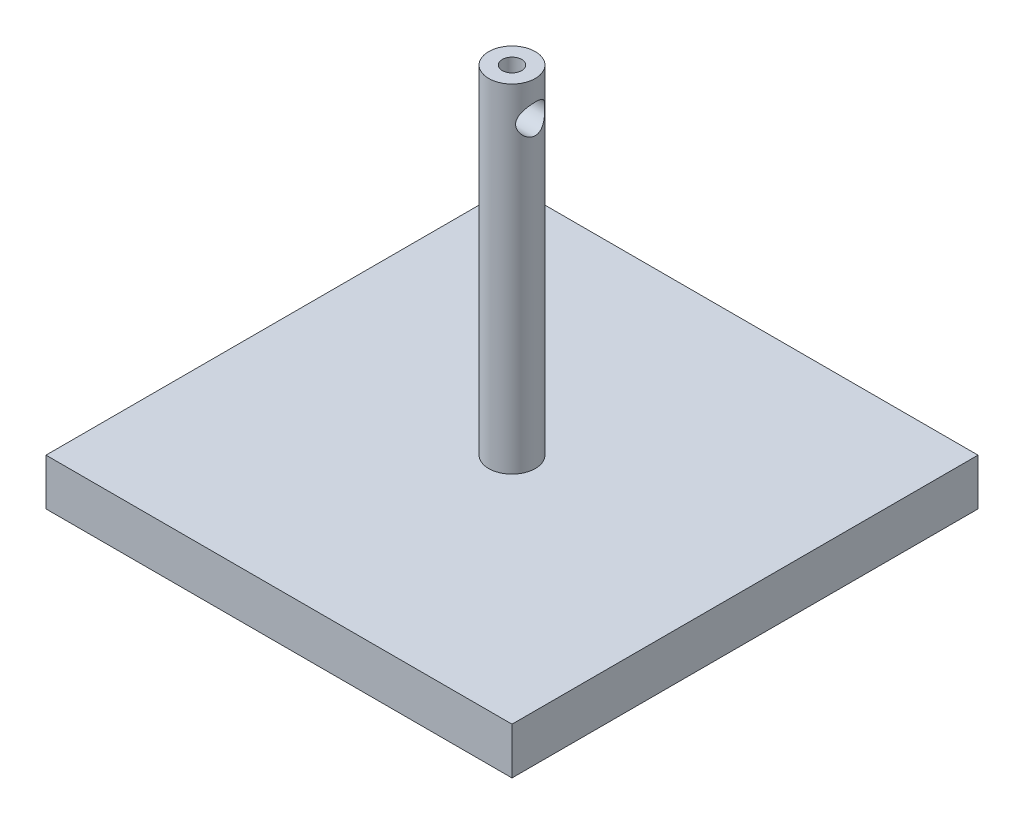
ISO-10303-21;
HEADER;
FILE_DESCRIPTION(('STEP AP214'),'2;1');
FILE_NAME('part.step','',(''),(''),'','','');
FILE_SCHEMA(('AUTOMOTIVE_DESIGN { 1 0 10303 214 1 1 1 1 }'));
ENDSEC;
DATA;
#1=APPLICATION_CONTEXT('core data for automotive mechanical design processes');
#2=APPLICATION_PROTOCOL_DEFINITION('international standard','automotive_design',2000,#1);
#3=PRODUCT_CONTEXT('',#1,'mechanical');
#4=PRODUCT('Part','Part','',(#3));
#5=PRODUCT_RELATED_PRODUCT_CATEGORY('part','',(#4));
#6=PRODUCT_DEFINITION_FORMATION('','',#4);
#7=PRODUCT_DEFINITION_CONTEXT('part definition',#1,'design');
#8=PRODUCT_DEFINITION('design','',#6,#7);
#9=PRODUCT_DEFINITION_SHAPE('','',#8);
#10=(LENGTH_UNIT() NAMED_UNIT(*) SI_UNIT(.MILLI.,.METRE.));
#11=(NAMED_UNIT(*) PLANE_ANGLE_UNIT() SI_UNIT($,.RADIAN.));
#12=(NAMED_UNIT(*) SI_UNIT($,.STERADIAN.) SOLID_ANGLE_UNIT());
#13=UNCERTAINTY_MEASURE_WITH_UNIT(LENGTH_MEASURE(1.E-05),#10,'distance_accuracy_value','');
#14=(GEOMETRIC_REPRESENTATION_CONTEXT(3) GLOBAL_UNCERTAINTY_ASSIGNED_CONTEXT((#13)) GLOBAL_UNIT_ASSIGNED_CONTEXT((#10,
#11,#12)) REPRESENTATION_CONTEXT('',''));
#15=CARTESIAN_POINT('',(0.,0.,0.));
#16=DIRECTION('',(0.,0.,1.));
#17=DIRECTION('',(1.,0.,0.));
#18=AXIS2_PLACEMENT_3D('',#15,#16,#17);
#19=CARTESIAN_POINT('',(25.4,5.08,25.4));
#20=DIRECTION('',(-1.,0.,0.));
#21=DIRECTION('',(0.,0.,1.));
#22=AXIS2_PLACEMENT_3D('',#19,#20,#21);
#23=PLANE('',#22);
#24=DIRECTION('',(0.,0.,-1.));
#25=VECTOR('',#24,1.);
#26=CARTESIAN_POINT('',(25.4,0.,25.4));
#27=LINE('',#26,#25);
#28=CARTESIAN_POINT('',(25.4,0.,25.4));
#29=VERTEX_POINT('',#28);
#30=CARTESIAN_POINT('',(25.4,0.,-25.4));
#31=VERTEX_POINT('',#30);
#32=EDGE_CURVE('E112',#29,#31,#27,.T.);
#33=ORIENTED_EDGE('',*,*,#32,.T.);
#34=DIRECTION('',(0.,-1.,0.));
#35=VECTOR('',#34,1.);
#36=CARTESIAN_POINT('',(25.4,5.08,-25.4));
#37=LINE('',#36,#35);
#38=CARTESIAN_POINT('',(25.4,5.08,-25.4));
#39=VERTEX_POINT('',#38);
#40=EDGE_CURVE('E53',#39,#31,#37,.T.);
#41=ORIENTED_EDGE('',*,*,#40,.F.);
#42=DIRECTION('',(0.,0.,-1.));
#43=VECTOR('',#42,1.);
#44=CARTESIAN_POINT('',(25.4,5.08,25.4));
#45=LINE('',#44,#43);
#46=CARTESIAN_POINT('',(25.4,5.08,25.4));
#47=VERTEX_POINT('',#46);
#48=EDGE_CURVE('E98',#47,#39,#45,.T.);
#49=ORIENTED_EDGE('',*,*,#48,.F.);
#50=DIRECTION('',(0.,-1.,0.));
#51=VECTOR('',#50,1.);
#52=CARTESIAN_POINT('',(25.4,5.08,25.4));
#53=LINE('',#52,#51);
#54=EDGE_CURVE('E108',#47,#29,#53,.T.);
#55=ORIENTED_EDGE('',*,*,#54,.T.);
#56=EDGE_LOOP('',(#33,#41,#49,#55));
#57=FACE_BOUND('',#56,.T.);
#58=ADVANCED_FACE('F39',(#57),#23,.F.);
#59=CARTESIAN_POINT('',(-25.4,5.08,-25.4));
#60=DIRECTION('',(0.,0.,1.));
#61=DIRECTION('',(1.,0.,0.));
#62=AXIS2_PLACEMENT_3D('',#59,#60,#61);
#63=PLANE('',#62);
#64=DIRECTION('',(-1.,0.,0.));
#65=VECTOR('',#64,1.);
#66=CARTESIAN_POINT('',(-25.4,0.,-25.4));
#67=LINE('',#66,#65);
#68=CARTESIAN_POINT('',(-25.4,0.,-25.4));
#69=VERTEX_POINT('',#68);
#70=EDGE_CURVE('E103',#31,#69,#67,.T.);
#71=ORIENTED_EDGE('',*,*,#70,.T.);
#72=DIRECTION('',(0.,-1.,0.));
#73=VECTOR('',#72,1.);
#74=CARTESIAN_POINT('',(-25.4,5.08,-25.4));
#75=LINE('',#74,#73);
#76=CARTESIAN_POINT('',(-25.4,5.08,-25.4));
#77=VERTEX_POINT('',#76);
#78=EDGE_CURVE('E101',#77,#69,#75,.T.);
#79=ORIENTED_EDGE('',*,*,#78,.F.);
#80=DIRECTION('',(-1.,0.,0.));
#81=VECTOR('',#80,1.);
#82=CARTESIAN_POINT('',(-25.4,5.08,-25.4));
#83=LINE('',#82,#81);
#84=EDGE_CURVE('E93',#39,#77,#83,.T.);
#85=ORIENTED_EDGE('',*,*,#84,.F.);
#86=ORIENTED_EDGE('',*,*,#40,.T.);
#87=EDGE_LOOP('',(#71,#79,#85,#86));
#88=FACE_BOUND('',#87,.T.);
#89=ADVANCED_FACE('F102',(#88),#63,.F.);
#90=CARTESIAN_POINT('',(-25.4,5.08,25.4));
#91=DIRECTION('',(1.,0.,0.));
#92=DIRECTION('',(0.,0.,-1.));
#93=AXIS2_PLACEMENT_3D('',#90,#91,#92);
#94=PLANE('',#93);
#95=DIRECTION('',(0.,0.,1.));
#96=VECTOR('',#95,1.);
#97=CARTESIAN_POINT('',(-25.4,0.,25.4));
#98=LINE('',#97,#96);
#99=CARTESIAN_POINT('',(-25.4,0.,25.4));
#100=VERTEX_POINT('',#99);
#101=EDGE_CURVE('E79',#69,#100,#98,.T.);
#102=ORIENTED_EDGE('',*,*,#101,.T.);
#103=DIRECTION('',(0.,-1.,0.));
#104=VECTOR('',#103,1.);
#105=CARTESIAN_POINT('',(-25.4,5.08,25.4));
#106=LINE('',#105,#104);
#107=CARTESIAN_POINT('',(-25.4,5.08,25.4));
#108=VERTEX_POINT('',#107);
#109=EDGE_CURVE('E104',#108,#100,#106,.T.);
#110=ORIENTED_EDGE('',*,*,#109,.F.);
#111=DIRECTION('',(0.,0.,1.));
#112=VECTOR('',#111,1.);
#113=CARTESIAN_POINT('',(-25.4,5.08,25.4));
#114=LINE('',#113,#112);
#115=EDGE_CURVE('E96',#77,#108,#114,.T.);
#116=ORIENTED_EDGE('',*,*,#115,.F.);
#117=ORIENTED_EDGE('',*,*,#78,.T.);
#118=EDGE_LOOP('',(#102,#110,#116,#117));
#119=FACE_BOUND('',#118,.T.);
#120=ADVANCED_FACE('F106',(#119),#94,.F.);
#121=CARTESIAN_POINT('',(-25.4,5.08,25.4));
#122=DIRECTION('',(0.,0.,-1.));
#123=DIRECTION('',(-1.,0.,0.));
#124=AXIS2_PLACEMENT_3D('',#121,#122,#123);
#125=PLANE('',#124);
#126=DIRECTION('',(1.,0.,0.));
#127=VECTOR('',#126,1.);
#128=CARTESIAN_POINT('',(-25.4,0.,25.4));
#129=LINE('',#128,#127);
#130=EDGE_CURVE('E85',#100,#29,#129,.T.);
#131=ORIENTED_EDGE('',*,*,#130,.T.);
#132=ORIENTED_EDGE('',*,*,#54,.F.);
#133=DIRECTION('',(1.,0.,0.));
#134=VECTOR('',#133,1.);
#135=CARTESIAN_POINT('',(-25.4,5.08,25.4));
#136=LINE('',#135,#134);
#137=EDGE_CURVE('E62',#108,#47,#136,.T.);
#138=ORIENTED_EDGE('',*,*,#137,.F.);
#139=ORIENTED_EDGE('',*,*,#109,.T.);
#140=EDGE_LOOP('',(#131,#132,#138,#139));
#141=FACE_BOUND('',#140,.T.);
#142=ADVANCED_FACE('F163',(#141),#125,.F.);
#143=CARTESIAN_POINT('',(0.,5.08,0.));
#144=DIRECTION('',(0.,-1.,0.));
#145=DIRECTION('',(0.,0.,-1.));
#146=AXIS2_PLACEMENT_3D('',#143,#144,#145);
#147=PLANE('',#146);
#148=CARTESIAN_POINT('',(0.,5.08,0.));
#149=DIRECTION('',(0.,-1.,0.));
#150=DIRECTION('',(0.,0.,-1.));
#151=AXIS2_PLACEMENT_3D('',#148,#149,#150);
#152=CIRCLE('',#151,2.54);
#153=CARTESIAN_POINT('',(0.,5.08,-2.54));
#154=VERTEX_POINT('',#153);
#155=EDGE_CURVE('E11',#154,#154,#152,.F.);
#156=ORIENTED_EDGE('',*,*,#155,.F.);
#157=EDGE_LOOP('',(#156));
#158=FACE_BOUND('',#157,.T.);
#159=ORIENTED_EDGE('',*,*,#48,.T.);
#160=ORIENTED_EDGE('',*,*,#84,.T.);
#161=ORIENTED_EDGE('',*,*,#115,.T.);
#162=ORIENTED_EDGE('',*,*,#137,.T.);
#163=EDGE_LOOP('',(#159,#160,#161,#162));
#164=FACE_BOUND('',#163,.T.);
#165=ADVANCED_FACE('F94',(#158,#164),#147,.F.);
#166=CARTESIAN_POINT('',(0.,0.,0.));
#167=DIRECTION('',(0.,-1.,0.));
#168=DIRECTION('',(0.,0.,-1.));
#169=AXIS2_PLACEMENT_3D('',#166,#167,#168);
#170=PLANE('',#169);
#171=CARTESIAN_POINT('',(0.,0.,0.));
#172=DIRECTION('',(0.,-1.,0.));
#173=DIRECTION('',(0.,0.,-1.));
#174=AXIS2_PLACEMENT_3D('',#171,#172,#173);
#175=CIRCLE('',#174,4.064);
#176=CARTESIAN_POINT('',(0.,0.,-4.064));
#177=VERTEX_POINT('',#176);
#178=EDGE_CURVE('E245',#177,#177,#175,.T.);
#179=ORIENTED_EDGE('',*,*,#178,.F.);
#180=EDGE_LOOP('',(#179));
#181=FACE_BOUND('',#180,.T.);
#182=ORIENTED_EDGE('',*,*,#32,.F.);
#183=ORIENTED_EDGE('',*,*,#130,.F.);
#184=ORIENTED_EDGE('',*,*,#101,.F.);
#185=ORIENTED_EDGE('',*,*,#70,.F.);
#186=EDGE_LOOP('',(#182,#183,#184,#185));
#187=FACE_BOUND('',#186,.T.);
#188=ADVANCED_FACE('F146',(#181,#187),#170,.T.);
#189=CARTESIAN_POINT('',(0.,41.91,0.));
#190=DIRECTION('',(0.,-1.,0.));
#191=DIRECTION('',(0.,0.,-1.));
#192=AXIS2_PLACEMENT_3D('',#189,#190,#191);
#193=CYLINDRICAL_SURFACE('',#192,2.54);
#194=CARTESIAN_POINT('',(-1.98278686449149,38.1,-1.5875));
#195=CARTESIAN_POINT('',(-1.9827976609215,38.1788927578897,-1.58749317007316));
#196=CARTESIAN_POINT('',(-1.98758356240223,38.2579090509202,-1.58156521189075));
#197=CARTESIAN_POINT('',(-2.00588520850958,38.4132789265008,-1.55827667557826));
#198=CARTESIAN_POINT('',(-2.01942466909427,38.4896246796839,-1.54088503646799));
#199=CARTESIAN_POINT('',(-2.05295608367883,38.6369335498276,-1.49590853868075));
#200=CARTESIAN_POINT('',(-2.07289193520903,38.7079370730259,-1.46841201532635));
#201=CARTESIAN_POINT('',(-2.11687347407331,38.8442312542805,-1.40426370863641));
#202=CARTESIAN_POINT('',(-2.1409192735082,38.9095217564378,-1.36761167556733));
#203=CARTESIAN_POINT('',(-2.19430106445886,39.0421687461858,-1.28046401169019));
#204=CARTESIAN_POINT('',(-2.22391399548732,39.1086273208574,-1.22877083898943));
#205=CARTESIAN_POINT('',(-2.28286082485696,39.2326910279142,-1.11545200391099));
#206=CARTESIAN_POINT('',(-2.31219445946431,39.2902884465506,-1.05381778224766));
#207=CARTESIAN_POINT('',(-2.37146406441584,39.4018815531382,-0.913367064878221));
#208=CARTESIAN_POINT('',(-2.40104577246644,39.4546044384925,-0.833374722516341));
#209=CARTESIAN_POINT('',(-2.4534270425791,39.5454190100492,-0.663453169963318));
#210=CARTESIAN_POINT('',(-2.47623331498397,39.5835251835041,-0.573533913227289));
#211=CARTESIAN_POINT('',(-2.51040698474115,39.639852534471,-0.395956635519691));
#212=CARTESIAN_POINT('',(-2.52270161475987,39.6597014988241,-0.308998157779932));
#213=CARTESIAN_POINT('',(-2.5381019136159,39.6844927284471,-0.132213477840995));
#214=CARTESIAN_POINT('',(-2.54121724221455,39.6894506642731,-0.042390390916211));
#215=CARTESIAN_POINT('',(-2.53813194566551,39.6845082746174,0.124543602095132));
#216=CARTESIAN_POINT('',(-2.53312548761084,39.6765127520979,0.201742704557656));
#217=CARTESIAN_POINT('',(-2.51644495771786,39.6495689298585,0.35344944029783));
#218=CARTESIAN_POINT('',(-2.50477038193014,39.6306198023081,0.427956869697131));
#219=CARTESIAN_POINT('',(-2.4757142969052,39.5825932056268,0.572629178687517));
#220=CARTESIAN_POINT('',(-2.45831819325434,39.553489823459,0.642782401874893));
#221=CARTESIAN_POINT('',(-2.41916753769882,39.4862446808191,0.777264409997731));
#222=CARTESIAN_POINT('',(-2.39741199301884,39.4481008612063,0.841591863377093));
#223=CARTESIAN_POINT('',(-2.34814395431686,39.3585342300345,0.971186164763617));
#224=CARTESIAN_POINT('',(-2.32025195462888,39.3060496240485,1.03557367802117));
#225=CARTESIAN_POINT('',(-2.26308237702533,39.1920318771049,1.155190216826));
#226=CARTESIAN_POINT('',(-2.23380282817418,39.1304855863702,1.21040568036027));
#227=CARTESIAN_POINT('',(-2.17260731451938,38.9906438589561,1.31744016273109));
#228=CARTESIAN_POINT('',(-2.14084638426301,38.9112107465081,1.36787401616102));
#229=CARTESIAN_POINT('',(-2.08297956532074,38.7430694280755,1.45448214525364));
#230=CARTESIAN_POINT('',(-2.05686330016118,38.6543786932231,1.49068268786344));
#231=CARTESIAN_POINT('',(-2.02046683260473,38.4939928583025,1.539475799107));
#232=CARTESIAN_POINT('',(-2.00782814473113,38.4239630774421,1.55577338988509));
#233=CARTESIAN_POINT('',(-1.98982506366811,38.2814637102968,1.57873914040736));
#234=CARTESIAN_POINT('',(-1.98445073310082,38.2089975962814,1.58542045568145));
#235=CARTESIAN_POINT('',(-1.98178589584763,38.0635145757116,1.58875140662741));
#236=CARTESIAN_POINT('',(-1.98451391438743,37.9904967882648,1.5853780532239));
#237=CARTESIAN_POINT('',(-1.99765974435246,37.8462786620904,1.56877681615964));
#238=CARTESIAN_POINT('',(-2.00808392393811,37.7750798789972,1.55554077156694));
#239=CARTESIAN_POINT('',(-2.03492176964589,37.6374426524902,1.52025268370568));
#240=CARTESIAN_POINT('',(-2.05123386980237,37.5709450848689,1.49834956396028));
#241=CARTESIAN_POINT('',(-2.08807778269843,37.4424100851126,1.44656113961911));
#242=CARTESIAN_POINT('',(-2.10861109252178,37.3803742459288,1.41667300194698));
#243=CARTESIAN_POINT('',(-2.15629749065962,37.2499813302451,1.34322028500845));
#244=CARTESIAN_POINT('',(-2.18396662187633,37.1826694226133,1.29813524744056));
#245=CARTESIAN_POINT('',(-2.24020326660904,37.0558249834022,1.19848663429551));
#246=CARTESIAN_POINT('',(-2.26877168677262,36.9963006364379,1.14391322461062));
#247=CARTESIAN_POINT('',(-2.32896618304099,36.8770112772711,1.01648343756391));
#248=CARTESIAN_POINT('',(-2.36034840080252,36.8187369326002,0.942098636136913));
#249=CARTESIAN_POINT('',(-2.41787996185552,36.7156128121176,0.78270098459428));
#250=CARTESIAN_POINT('',(-2.44403175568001,36.6707567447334,0.697693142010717));
#251=CARTESIAN_POINT('',(-2.48677755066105,36.5988663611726,0.524415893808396));
#252=CARTESIAN_POINT('',(-2.5038492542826,36.5709273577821,0.436644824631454));
#253=CARTESIAN_POINT('',(-2.52865902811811,36.530627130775,0.256363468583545));
#254=CARTESIAN_POINT('',(-2.53641001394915,36.5182443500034,0.163859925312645));
#255=CARTESIAN_POINT('',(-2.5412279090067,36.5105359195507,-0.008380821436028));
#256=CARTESIAN_POINT('',(-2.53970282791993,36.5129625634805,-0.0879872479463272));
#257=CARTESIAN_POINT('',(-2.5293413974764,36.5295963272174,-0.245465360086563));
#258=CARTESIAN_POINT('',(-2.52050537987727,36.5438029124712,-0.323337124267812));
#259=CARTESIAN_POINT('',(-2.49677052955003,36.5825538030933,-0.472494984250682));
#260=CARTESIAN_POINT('',(-2.48209266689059,36.606722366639,-0.543915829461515));
#261=CARTESIAN_POINT('',(-2.44786110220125,36.6643411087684,-0.681627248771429));
#262=CARTESIAN_POINT('',(-2.42830657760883,36.697792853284,-0.747916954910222));
#263=CARTESIAN_POINT('',(-2.38347684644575,36.7768639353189,-0.880944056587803));
#264=CARTESIAN_POINT('',(-2.35781853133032,36.8233858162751,-0.947013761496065));
#265=CARTESIAN_POINT('',(-2.30420723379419,36.9253473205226,-1.07088509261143));
#266=CARTESIAN_POINT('',(-2.27625167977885,36.9807970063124,-1.1286772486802));
#267=CARTESIAN_POINT('',(-2.21615527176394,37.1082776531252,-1.24297897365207));
#268=CARTESIAN_POINT('',(-2.18399196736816,37.1815465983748,-1.29810293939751));
#269=CARTESIAN_POINT('',(-2.12312023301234,37.3375487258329,-1.39544202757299));
#270=CARTESIAN_POINT('',(-2.09440989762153,37.4202766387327,-1.4376642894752));
#271=CARTESIAN_POINT('',(-2.05015815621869,37.5747315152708,-1.49985870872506));
#272=CARTESIAN_POINT('',(-2.03310922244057,37.6448773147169,-1.52268194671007));
#273=CARTESIAN_POINT('',(-2.00582731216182,37.7888109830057,-1.55845284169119));
#274=CARTESIAN_POINT('',(-1.99557277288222,37.8625865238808,-1.57143175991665));
#275=CARTESIAN_POINT('',(-1.9872509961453,37.9641487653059,-1.58191080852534));
#276=CARTESIAN_POINT('',(-1.9855823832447,37.9912424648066,-1.58400332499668));
#277=CARTESIAN_POINT('',(-1.98334831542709,38.0455525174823,-1.58679927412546));
#278=CARTESIAN_POINT('',(-1.98278313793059,38.0727688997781,-1.58750235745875));
#279=CARTESIAN_POINT('',(-1.98278686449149,38.1,-1.5875));
#280=B_SPLINE_CURVE_WITH_KNOTS('',3,(#194,#195,#196,#197,#198,#199,#200,#201,#202,#203,#204,
#205,#206,#207,#208,#209,#210,#211,#212,#213,#214,#215,#216,#217,#218,#219,#220,#221,#222,#223,
#224,#225,#226,#227,#228,#229,#230,#231,#232,#233,#234,#235,#236,#237,#238,#239,#240,#241,#242,
#243,#244,#245,#246,#247,#248,#249,#250,#251,#252,#253,#254,#255,#256,#257,#258,#259,#260,#261,
#262,#263,#264,#265,#266,#267,#268,#269,#270,#271,#272,#273,#274,#275,#276,#277,#278,#279),
.UNSPECIFIED.,.T.,.F.,(4,2,2,2,2,2,2,2,2,2,2,2,2,2,2,2,2,2,2,2,2,2,2,2,2,2,2,2,2,2,2,2,2,2,2,2,
2,2,2,2,2,2,4),(0.,0.236553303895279,0.473750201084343,0.708921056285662,0.944098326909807,
1.21082588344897,1.47778433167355,1.77694889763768,2.07581617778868,2.34429824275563,
2.61249767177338,2.84470245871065,3.07692479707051,3.3097441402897,3.54261656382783,
3.80446921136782,4.06670565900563,4.36318746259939,4.65911952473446,4.87721624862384,
5.09501432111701,5.31331075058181,5.53178801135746,5.74666379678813,5.96161592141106,
6.21749243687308,6.47363575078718,6.77083480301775,7.0678942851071,7.34720502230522,
7.62612827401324,7.86388573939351,8.10163241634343,8.33113102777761,8.56066837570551,
8.8140304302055,9.06768007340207,9.35789108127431,9.64794120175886,9.8742106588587,
10.0997585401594,10.181388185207,10.2630383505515),.UNSPECIFIED.);
#281=CARTESIAN_POINT('',(-1.98278686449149,38.1,-1.5875));
#282=VERTEX_POINT('',#281);
#283=EDGE_CURVE('E42',#282,#282,#280,.T.);
#284=ORIENTED_EDGE('',*,*,#283,.T.);
#285=EDGE_LOOP('',(#284));
#286=FACE_BOUND('',#285,.T.);
#287=CARTESIAN_POINT('',(1.98278686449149,38.1,-1.5875));
#288=CARTESIAN_POINT('',(1.98279766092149,38.0211072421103,-1.58749317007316));
#289=CARTESIAN_POINT('',(1.98758356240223,37.9420909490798,-1.58156521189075));
#290=CARTESIAN_POINT('',(2.00588520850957,37.7867210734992,-1.55827667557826));
#291=CARTESIAN_POINT('',(2.01942466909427,37.7103753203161,-1.54088503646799));
#292=CARTESIAN_POINT('',(2.05295608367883,37.5630664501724,-1.49590853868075));
#293=CARTESIAN_POINT('',(2.07289193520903,37.4920629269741,-1.46841201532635));
#294=CARTESIAN_POINT('',(2.11687347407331,37.3557687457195,-1.40426370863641));
#295=CARTESIAN_POINT('',(2.1409192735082,37.2904782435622,-1.36761167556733));
#296=CARTESIAN_POINT('',(2.19430106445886,37.1578312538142,-1.28046401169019));
#297=CARTESIAN_POINT('',(2.22391399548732,37.0913726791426,-1.22877083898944));
#298=CARTESIAN_POINT('',(2.28286082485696,36.9673089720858,-1.11545200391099));
#299=CARTESIAN_POINT('',(2.31219445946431,36.9097115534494,-1.05381778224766));
#300=CARTESIAN_POINT('',(2.37146406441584,36.7981184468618,-0.913367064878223));
#301=CARTESIAN_POINT('',(2.40104577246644,36.7453955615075,-0.833374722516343));
#302=CARTESIAN_POINT('',(2.4534270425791,36.6545809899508,-0.663453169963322));
#303=CARTESIAN_POINT('',(2.47623331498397,36.6164748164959,-0.573533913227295));
#304=CARTESIAN_POINT('',(2.51040698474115,36.560147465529,-0.395956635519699));
#305=CARTESIAN_POINT('',(2.52270161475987,36.5402985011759,-0.30899815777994));
#306=CARTESIAN_POINT('',(2.5381019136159,36.5155072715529,-0.132213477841));
#307=CARTESIAN_POINT('',(2.54121724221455,36.5105493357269,-0.0423903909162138));
#308=CARTESIAN_POINT('',(2.53813194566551,36.5154917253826,0.124543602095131));
#309=CARTESIAN_POINT('',(2.53312548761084,36.5234872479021,0.201742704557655));
#310=CARTESIAN_POINT('',(2.51644495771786,36.5504310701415,0.35344944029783));
#311=CARTESIAN_POINT('',(2.50477038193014,36.5693801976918,0.427956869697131));
#312=CARTESIAN_POINT('',(2.4757142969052,36.6174067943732,0.572629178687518));
#313=CARTESIAN_POINT('',(2.45831819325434,36.646510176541,0.642782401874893));
#314=CARTESIAN_POINT('',(2.41916753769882,36.7137553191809,0.777264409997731));
#315=CARTESIAN_POINT('',(2.39741199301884,36.7518991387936,0.841591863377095));
#316=CARTESIAN_POINT('',(2.34814395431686,36.8414657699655,0.971186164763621));
#317=CARTESIAN_POINT('',(2.32025195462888,36.8939503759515,1.03557367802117));
#318=CARTESIAN_POINT('',(2.26308237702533,37.0079681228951,1.155190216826));
#319=CARTESIAN_POINT('',(2.23380282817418,37.0695144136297,1.21040568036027));
#320=CARTESIAN_POINT('',(2.17260731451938,37.2093561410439,1.31744016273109));
#321=CARTESIAN_POINT('',(2.14084638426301,37.2887892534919,1.36787401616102));
#322=CARTESIAN_POINT('',(2.08297956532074,37.4569305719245,1.45448214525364));
#323=CARTESIAN_POINT('',(2.05686330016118,37.5456213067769,1.49068268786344));
#324=CARTESIAN_POINT('',(2.02046683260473,37.7060071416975,1.539475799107));
#325=CARTESIAN_POINT('',(2.00782814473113,37.7760369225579,1.55577338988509));
#326=CARTESIAN_POINT('',(1.98982506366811,37.9185362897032,1.57873914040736));
#327=CARTESIAN_POINT('',(1.98445073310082,37.9910024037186,1.58542045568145));
#328=CARTESIAN_POINT('',(1.98178589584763,38.1364854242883,1.58875140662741));
#329=CARTESIAN_POINT('',(1.98451391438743,38.2095032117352,1.5853780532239));
#330=CARTESIAN_POINT('',(1.99765974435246,38.3537213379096,1.56877681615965));
#331=CARTESIAN_POINT('',(2.00808392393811,38.4249201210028,1.55554077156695));
#332=CARTESIAN_POINT('',(2.03492176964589,38.5625573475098,1.52025268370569));
#333=CARTESIAN_POINT('',(2.05123386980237,38.6290549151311,1.49834956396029));
#334=CARTESIAN_POINT('',(2.08807778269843,38.7575899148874,1.44656113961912));
#335=CARTESIAN_POINT('',(2.10861109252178,38.8196257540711,1.41667300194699));
#336=CARTESIAN_POINT('',(2.15629749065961,38.9500186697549,1.34322028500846));
#337=CARTESIAN_POINT('',(2.18396662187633,39.0173305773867,1.29813524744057));
#338=CARTESIAN_POINT('',(2.24020326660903,39.1441750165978,1.19848663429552));
#339=CARTESIAN_POINT('',(2.26877168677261,39.2036993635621,1.14391322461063));
#340=CARTESIAN_POINT('',(2.32896618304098,39.3229887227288,1.01648343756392));
#341=CARTESIAN_POINT('',(2.36034840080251,39.3812630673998,0.94209863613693));
#342=CARTESIAN_POINT('',(2.41787996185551,39.4843871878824,0.782700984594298));
#343=CARTESIAN_POINT('',(2.44403175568,39.5292432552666,0.697693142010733));
#344=CARTESIAN_POINT('',(2.48677755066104,39.6011336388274,0.52441589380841));
#345=CARTESIAN_POINT('',(2.5038492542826,39.6290726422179,0.436644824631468));
#346=CARTESIAN_POINT('',(2.52865902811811,39.669372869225,0.256363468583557));
#347=CARTESIAN_POINT('',(2.53641001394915,39.6817556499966,0.163859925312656));
#348=CARTESIAN_POINT('',(2.5412279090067,39.6894640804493,-0.00838082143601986));
#349=CARTESIAN_POINT('',(2.53970282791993,39.6870374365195,-0.0879872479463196));
#350=CARTESIAN_POINT('',(2.5293413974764,39.6704036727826,-0.245465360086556));
#351=CARTESIAN_POINT('',(2.52050537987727,39.6561970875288,-0.323337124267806));
#352=CARTESIAN_POINT('',(2.49677052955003,39.6174461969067,-0.472494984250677));
#353=CARTESIAN_POINT('',(2.48209266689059,39.593277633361,-0.543915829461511));
#354=CARTESIAN_POINT('',(2.44786110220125,39.5356588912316,-0.681627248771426));
#355=CARTESIAN_POINT('',(2.42830657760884,39.502207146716,-0.74791695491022));
#356=CARTESIAN_POINT('',(2.38347684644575,39.4231360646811,-0.880944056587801));
#357=CARTESIAN_POINT('',(2.35781853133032,39.3766141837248,-0.947013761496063));
#358=CARTESIAN_POINT('',(2.3042072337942,39.2746526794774,-1.07088509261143));
#359=CARTESIAN_POINT('',(2.27625167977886,39.2192029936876,-1.12867724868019));
#360=CARTESIAN_POINT('',(2.21615527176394,39.0917223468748,-1.24297897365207));
#361=CARTESIAN_POINT('',(2.18399196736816,39.0184534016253,-1.29810293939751));
#362=CARTESIAN_POINT('',(2.12312023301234,38.8624512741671,-1.39544202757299));
#363=CARTESIAN_POINT('',(2.09440989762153,38.7797233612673,-1.4376642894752));
#364=CARTESIAN_POINT('',(2.05015815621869,38.6252684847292,-1.49985870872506));
#365=CARTESIAN_POINT('',(2.03310922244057,38.5551226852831,-1.52268194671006));
#366=CARTESIAN_POINT('',(2.00582731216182,38.4111890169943,-1.55845284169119));
#367=CARTESIAN_POINT('',(1.99557277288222,38.3374134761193,-1.57143175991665));
#368=CARTESIAN_POINT('',(1.9872509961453,38.2358512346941,-1.58191080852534));
#369=CARTESIAN_POINT('',(1.9855823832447,38.2087575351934,-1.58400332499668));
#370=CARTESIAN_POINT('',(1.98334831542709,38.1544474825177,-1.58679927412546));
#371=CARTESIAN_POINT('',(1.98278313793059,38.1272311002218,-1.58750235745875));
#372=CARTESIAN_POINT('',(1.98278686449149,38.1,-1.5875));
#373=B_SPLINE_CURVE_WITH_KNOTS('',3,(#287,#288,#289,#290,#291,#292,#293,#294,#295,#296,#297,
#298,#299,#300,#301,#302,#303,#304,#305,#306,#307,#308,#309,#310,#311,#312,#313,#314,#315,#316,
#317,#318,#319,#320,#321,#322,#323,#324,#325,#326,#327,#328,#329,#330,#331,#332,#333,#334,#335,
#336,#337,#338,#339,#340,#341,#342,#343,#344,#345,#346,#347,#348,#349,#350,#351,#352,#353,#354,
#355,#356,#357,#358,#359,#360,#361,#362,#363,#364,#365,#366,#367,#368,#369,#370,#371,#372),
.UNSPECIFIED.,.T.,.F.,(4,2,2,2,2,2,2,2,2,2,2,2,2,2,2,2,2,2,2,2,2,2,2,2,2,2,2,2,2,2,2,2,2,2,2,2,
2,2,2,2,2,2,4),(0.,0.236553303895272,0.473750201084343,0.708921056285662,0.944098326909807,
1.21082588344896,1.47778433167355,1.77694889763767,2.07581617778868,2.34429824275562,
2.61249767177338,2.84470245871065,3.07692479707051,3.30974414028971,3.54261656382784,
3.80446921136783,4.06670565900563,4.36318746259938,4.65911952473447,4.87721624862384,
5.09501432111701,5.3133107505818,5.53178801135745,5.74666379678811,5.96161592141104,
6.21749243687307,6.47363575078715,6.77083480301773,7.06789428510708,7.3472050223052,
7.62612827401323,7.8638857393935,8.10163241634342,8.3311310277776,8.56066837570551,
8.8140304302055,9.06768007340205,9.35789108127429,9.64794120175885,9.87421065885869,
10.0997585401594,10.181388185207,10.2630383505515),.UNSPECIFIED.);
#374=CARTESIAN_POINT('',(1.98278686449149,38.1,-1.5875));
#375=VERTEX_POINT('',#374);
#376=EDGE_CURVE('E121',#375,#375,#373,.T.);
#377=ORIENTED_EDGE('',*,*,#376,.T.);
#378=EDGE_LOOP('',(#377));
#379=FACE_BOUND('',#378,.T.);
#380=CARTESIAN_POINT('',(0.,41.91,0.));
#381=DIRECTION('',(0.,1.,0.));
#382=DIRECTION('',(0.,0.,1.));
#383=AXIS2_PLACEMENT_3D('',#380,#381,#382);
#384=CIRCLE('',#383,2.54);
#385=CARTESIAN_POINT('',(0.,41.91,2.54));
#386=VERTEX_POINT('',#385);
#387=EDGE_CURVE('E115',#386,#386,#384,.T.);
#388=ORIENTED_EDGE('',*,*,#387,.F.);
#389=EDGE_LOOP('',(#388));
#390=FACE_BOUND('',#389,.T.);
#391=ORIENTED_EDGE('',*,*,#155,.T.);
#392=EDGE_LOOP('',(#391));
#393=FACE_BOUND('',#392,.T.);
#394=ADVANCED_FACE('F127',(#286,#379,#390,#393),#193,.T.);
#395=CARTESIAN_POINT('',(0.,41.91,0.));
#396=DIRECTION('',(0.,1.,0.));
#397=DIRECTION('',(0.,0.,1.));
#398=AXIS2_PLACEMENT_3D('',#395,#396,#397);
#399=PLANE('',#398);
#400=CARTESIAN_POINT('',(0.,41.91,0.));
#401=DIRECTION('',(0.,1.,0.));
#402=DIRECTION('',(0.,0.,1.));
#403=AXIS2_PLACEMENT_3D('',#400,#401,#402);
#404=CIRCLE('',#403,1.05833333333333);
#405=CARTESIAN_POINT('',(0.,41.91,1.05833333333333));
#406=VERTEX_POINT('',#405);
#407=EDGE_CURVE('E126',#406,#406,#404,.T.);
#408=ORIENTED_EDGE('',*,*,#407,.F.);
#409=EDGE_LOOP('',(#408));
#410=FACE_BOUND('',#409,.T.);
#411=ORIENTED_EDGE('',*,*,#387,.T.);
#412=EDGE_LOOP('',(#411));
#413=FACE_BOUND('',#412,.T.);
#414=ADVANCED_FACE('F136',(#410,#413),#399,.T.);
#415=CARTESIAN_POINT('',(-25.4,38.1,0.));
#416=DIRECTION('',(1.,0.,0.));
#417=DIRECTION('',(0.,0.,-1.));
#418=AXIS2_PLACEMENT_3D('',#415,#416,#417);
#419=CYLINDRICAL_SURFACE('',#418,1.5875);
#420=CARTESIAN_POINT('',(0.,39.2832526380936,1.05833333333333));
#421=CARTESIAN_POINT('',(-0.0516616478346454,39.2832576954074,1.05833044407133));
#422=CARTESIAN_POINT('',(-0.103341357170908,39.2866989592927,1.05451800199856));
#423=CARTESIAN_POINT('',(-0.204850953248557,39.2997900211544,1.03959166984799));
#424=CARTESIAN_POINT('',(-0.254677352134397,39.3094509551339,1.0284646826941));
#425=CARTESIAN_POINT('',(-0.350697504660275,39.3332577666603,0.999785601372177));
#426=CARTESIAN_POINT('',(-0.396921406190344,39.3473599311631,0.982295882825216));
#427=CARTESIAN_POINT('',(-0.48570400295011,39.3783825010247,0.941567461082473));
#428=CARTESIAN_POINT('',(-0.528261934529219,39.3953034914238,0.91832756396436));
#429=CARTESIAN_POINT('',(-0.615763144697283,39.433214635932,0.862554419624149));
#430=CARTESIAN_POINT('',(-0.660046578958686,39.4544282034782,0.829137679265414));
#431=CARTESIAN_POINT('',(-0.742951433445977,39.4967080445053,0.755751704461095));
#432=CARTESIAN_POINT('',(-0.781567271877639,39.5177741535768,0.715776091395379));
#433=CARTESIAN_POINT('',(-0.857590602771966,39.5609699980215,0.623441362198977));
#434=CARTESIAN_POINT('',(-0.894017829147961,39.5828138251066,0.570127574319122));
#435=CARTESIAN_POINT('',(-0.957073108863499,39.6216636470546,0.456390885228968));
#436=CARTESIAN_POINT('',(-0.983712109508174,39.6386750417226,0.395976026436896));
#437=CARTESIAN_POINT('',(-1.0231735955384,39.6642161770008,0.276885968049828));
#438=CARTESIAN_POINT('',(-1.03721076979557,39.6734833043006,0.218775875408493));
#439=CARTESIAN_POINT('',(-1.0552559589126,39.6854349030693,0.100380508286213));
#440=CARTESIAN_POINT('',(-1.0592766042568,39.6881276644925,0.0400980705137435));
#441=CARTESIAN_POINT('',(-1.05718374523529,39.6867346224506,-0.0709861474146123));
#442=CARTESIAN_POINT('',(-1.05251829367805,39.6836173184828,-0.121835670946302));
#443=CARTESIAN_POINT('',(-1.03606015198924,39.6727266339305,-0.221847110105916));
#444=CARTESIAN_POINT('',(-1.02426694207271,39.6649529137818,-0.271008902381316));
#445=CARTESIAN_POINT('',(-0.994200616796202,39.6454423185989,-0.366224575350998));
#446=CARTESIAN_POINT('',(-0.975953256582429,39.633721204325,-0.412289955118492));
#447=CARTESIAN_POINT('',(-0.933686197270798,39.6071783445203,-0.500702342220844));
#448=CARTESIAN_POINT('',(-0.909665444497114,39.5923560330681,-0.543048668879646));
#449=CARTESIAN_POINT('',(-0.853027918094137,39.558478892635,-0.628800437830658));
#450=CARTESIAN_POINT('',(-0.819696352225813,39.5391238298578,-0.671613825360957));
#451=CARTESIAN_POINT('',(-0.747236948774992,39.4991198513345,-0.751410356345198));
#452=CARTESIAN_POINT('',(-0.708100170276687,39.4784689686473,-0.788384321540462));
#453=CARTESIAN_POINT('',(-0.618086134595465,39.4342939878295,-0.861336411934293));
#454=CARTESIAN_POINT('',(-0.566329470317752,39.4108216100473,-0.896268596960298));
#455=CARTESIAN_POINT('',(-0.456401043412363,39.3672251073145,-0.956917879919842));
#456=CARTESIAN_POINT('',(-0.398240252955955,39.347095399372,-0.98265042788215));
#457=CARTESIAN_POINT('',(-0.293836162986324,39.318474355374,-1.01776066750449));
#458=CARTESIAN_POINT('',(-0.248923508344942,39.3083010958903,-1.02970960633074));
#459=CARTESIAN_POINT('',(-0.157141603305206,39.2927895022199,-1.0476418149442));
#460=CARTESIAN_POINT('',(-0.11027589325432,39.287442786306,-1.05363542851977));
#461=CARTESIAN_POINT('',(-0.0156405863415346,39.2824099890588,-1.0592826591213));
#462=CARTESIAN_POINT('',(0.0321320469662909,39.282748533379,-1.05890869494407));
#463=CARTESIAN_POINT('',(0.126832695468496,39.2890897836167,-1.05178029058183));
#464=CARTESIAN_POINT('',(0.173759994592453,39.2950970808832,-1.04502067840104));
#465=CARTESIAN_POINT('',(0.263201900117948,39.3114105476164,-1.02605316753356));
#466=CARTESIAN_POINT('',(0.305820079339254,39.3214922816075,-1.01412767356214));
#467=CARTESIAN_POINT('',(0.388475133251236,39.3447585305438,-0.985430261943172));
#468=CARTESIAN_POINT('',(0.428511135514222,39.3579440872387,-0.968656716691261));
#469=CARTESIAN_POINT('',(0.513398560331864,39.389110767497,-0.926906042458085));
#470=CARTESIAN_POINT('',(0.557612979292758,39.4075236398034,-0.90095931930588));
#471=CARTESIAN_POINT('',(0.641570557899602,39.4454724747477,-0.843241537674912));
#472=CARTESIAN_POINT('',(0.681308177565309,39.4650097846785,-0.811463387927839));
#473=CARTESIAN_POINT('',(0.76409674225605,39.5079837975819,-0.734888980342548));
#474=CARTESIAN_POINT('',(0.805975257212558,39.5313400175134,-0.688765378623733));
#475=CARTESIAN_POINT('',(0.881494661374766,39.5751874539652,-0.589015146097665));
#476=CARTESIAN_POINT('',(0.915142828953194,39.5956811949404,-0.53539521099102));
#477=CARTESIAN_POINT('',(0.967259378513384,39.6281847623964,-0.432587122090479));
#478=CARTESIAN_POINT('',(0.987401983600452,39.641068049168,-0.384525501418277));
#479=CARTESIAN_POINT('',(1.02055464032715,39.6625164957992,-0.285092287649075));
#480=CARTESIAN_POINT('',(1.03357071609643,39.67108530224,-0.23372353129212));
#481=CARTESIAN_POINT('',(1.05182297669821,39.6831521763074,-0.128782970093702));
#482=CARTESIAN_POINT('',(1.05702453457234,39.6866276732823,-0.0752024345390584));
#483=CARTESIAN_POINT('',(1.05920532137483,39.6880811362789,0.0322027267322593));
#484=CARTESIAN_POINT('',(1.05618531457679,39.6860596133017,0.0860273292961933));
#485=CARTESIAN_POINT('',(1.04263852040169,39.6770730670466,0.188255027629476));
#486=CARTESIAN_POINT('',(1.03267352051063,39.6704781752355,0.236767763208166));
#487=CARTESIAN_POINT('',(1.00634905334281,39.6532952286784,0.331268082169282));
#488=CARTESIAN_POINT('',(0.98998859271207,39.6427065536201,0.377255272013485));
#489=CARTESIAN_POINT('',(0.950415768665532,39.6176064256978,0.46839044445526));
#490=CARTESIAN_POINT('',(0.926861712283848,39.602903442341,0.513335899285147));
#491=CARTESIAN_POINT('',(0.874103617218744,39.5709532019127,0.598779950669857));
#492=CARTESIAN_POINT('',(0.844896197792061,39.5537044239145,0.639275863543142));
#493=CARTESIAN_POINT('',(0.776483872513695,39.5149542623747,0.721409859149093));
#494=CARTESIAN_POINT('',(0.736429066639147,39.4932107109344,0.762225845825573));
#495=CARTESIAN_POINT('',(0.650285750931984,39.4496573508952,0.836930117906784));
#496=CARTESIAN_POINT('',(0.60419276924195,39.4278475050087,0.870813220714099));
#497=CARTESIAN_POINT('',(0.510186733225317,39.3879081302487,0.928757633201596));
#498=CARTESIAN_POINT('',(0.46268120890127,39.3696247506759,0.953371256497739));
#499=CARTESIAN_POINT('',(0.363386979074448,39.3369138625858,0.995446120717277));
#500=CARTESIAN_POINT('',(0.311606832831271,39.322478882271,1.01292125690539));
#501=CARTESIAN_POINT('',(0.216550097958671,39.3022193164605,1.03682938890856));
#502=CARTESIAN_POINT('',(0.173932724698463,39.295195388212,1.04485137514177));
#503=CARTESIAN_POINT('',(0.087547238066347,39.2857117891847,1.05560238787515));
#504=CARTESIAN_POINT('',(0.043780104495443,39.2832483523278,1.05833578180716));
#505=CARTESIAN_POINT('',(0.,39.2832526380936,1.05833333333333));
#506=B_SPLINE_CURVE_WITH_KNOTS('',3,(#420,#421,#422,#423,#424,#425,#426,#427,#428,#429,#430,
#431,#432,#433,#434,#435,#436,#437,#438,#439,#440,#441,#442,#443,#444,#445,#446,#447,#448,#449,
#450,#451,#452,#453,#454,#455,#456,#457,#458,#459,#460,#461,#462,#463,#464,#465,#466,#467,#468,
#469,#470,#471,#472,#473,#474,#475,#476,#477,#478,#479,#480,#481,#482,#483,#484,#485,#486,#487,
#488,#489,#490,#491,#492,#493,#494,#495,#496,#497,#498,#499,#500,#501,#502,#503,#504,#505),
.UNSPECIFIED.,.T.,.F.,(4,2,2,2,2,2,2,2,2,2,2,2,2,2,2,2,2,2,2,2,2,2,2,2,2,2,2,2,2,2,2,2,2,2,2,2,
2,2,2,2,2,2,4),(0.,0.15478491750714,0.30984774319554,0.463429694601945,0.617043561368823,
0.794568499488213,0.97226711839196,1.17563387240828,1.37877248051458,1.55912334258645,
1.73924667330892,1.8919800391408,2.04472454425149,2.19686627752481,2.34903579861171,
2.52120149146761,2.69363515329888,2.89284147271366,3.09171165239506,3.23387556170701,
3.37579211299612,3.51832353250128,3.66097049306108,3.79664622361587,3.93236755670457,
4.09521675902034,4.25826532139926,4.45693103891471,4.65542042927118,4.81579015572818,
4.97602410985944,5.13696600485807,5.2978929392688,5.44711880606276,5.59636786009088,
5.75425285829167,5.91223256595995,6.09505917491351,6.2780219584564,6.44701808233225,
6.6156836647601,6.74696292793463,6.87813373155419),.UNSPECIFIED.);
#507=CARTESIAN_POINT('',(0.,39.2832526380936,1.05833333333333));
#508=VERTEX_POINT('',#507);
#509=EDGE_CURVE('E237',#508,#508,#506,.T.);
#510=ORIENTED_EDGE('',*,*,#509,.F.);
#511=EDGE_LOOP('',(#510));
#512=FACE_BOUND('',#511,.T.);
#513=ORIENTED_EDGE('',*,*,#376,.F.);
#514=EDGE_LOOP('',(#513));
#515=FACE_BOUND('',#514,.T.);
#516=ORIENTED_EDGE('',*,*,#283,.F.);
#517=EDGE_LOOP('',(#516));
#518=FACE_BOUND('',#517,.T.);
#519=ADVANCED_FACE('F131',(#512,#515,#518),#419,.F.);
#520=CARTESIAN_POINT('',(0.,-0.001000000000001,0.));
#521=DIRECTION('',(0.,1.,0.));
#522=DIRECTION('',(0.,0.,1.));
#523=AXIS2_PLACEMENT_3D('',#520,#521,#522);
#524=CYLINDRICAL_SURFACE('',#523,1.05833333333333);
#525=ORIENTED_EDGE('',*,*,#407,.T.);
#526=EDGE_LOOP('',(#525));
#527=FACE_BOUND('',#526,.T.);
#528=ORIENTED_EDGE('',*,*,#509,.T.);
#529=EDGE_LOOP('',(#528));
#530=FACE_BOUND('',#529,.T.);
#531=ADVANCED_FACE('F135',(#527,#530),#524,.F.);
#532=CARTESIAN_POINT('',(0.,2.54,0.));
#533=DIRECTION('',(0.,-1.,0.));
#534=DIRECTION('',(0.,0.,-1.));
#535=AXIS2_PLACEMENT_3D('',#532,#533,#534);
#536=CYLINDRICAL_SURFACE('',#535,4.064);
#537=CARTESIAN_POINT('',(0.,2.54,0.));
#538=DIRECTION('',(0.,-1.,0.));
#539=DIRECTION('',(0.,0.,-1.));
#540=AXIS2_PLACEMENT_3D('',#537,#538,#539);
#541=CIRCLE('',#540,4.064);
#542=CARTESIAN_POINT('',(0.,2.54,-4.064));
#543=VERTEX_POINT('',#542);
#544=EDGE_CURVE('E244',#543,#543,#541,.T.);
#545=ORIENTED_EDGE('',*,*,#544,.F.);
#546=EDGE_LOOP('',(#545));
#547=FACE_BOUND('',#546,.T.);
#548=ORIENTED_EDGE('',*,*,#178,.T.);
#549=EDGE_LOOP('',(#548));
#550=FACE_BOUND('',#549,.T.);
#551=ADVANCED_FACE('F207',(#547,#550),#536,.F.);
#552=CARTESIAN_POINT('',(0.,2.54,0.));
#553=DIRECTION('',(0.,-1.,0.));
#554=DIRECTION('',(0.,0.,-1.));
#555=AXIS2_PLACEMENT_3D('',#552,#553,#554);
#556=PLANE('',#555);
#557=ORIENTED_EDGE('',*,*,#544,.T.);
#558=EDGE_LOOP('',(#557));
#559=FACE_BOUND('',#558,.T.);
#560=ADVANCED_FACE('F220',(#559),#556,.T.);
#561=CLOSED_SHELL('',(#58,#89,#120,#142,#165,#188,#394,#414,#519,#531,#551,#560));
#562=MANIFOLD_SOLID_BREP('B2',#561);
#563=ADVANCED_BREP_SHAPE_REPRESENTATION('',(#18,#562),#14);
#564=SHAPE_DEFINITION_REPRESENTATION(#9,#563);
ENDSEC;
END-ISO-10303-21;
